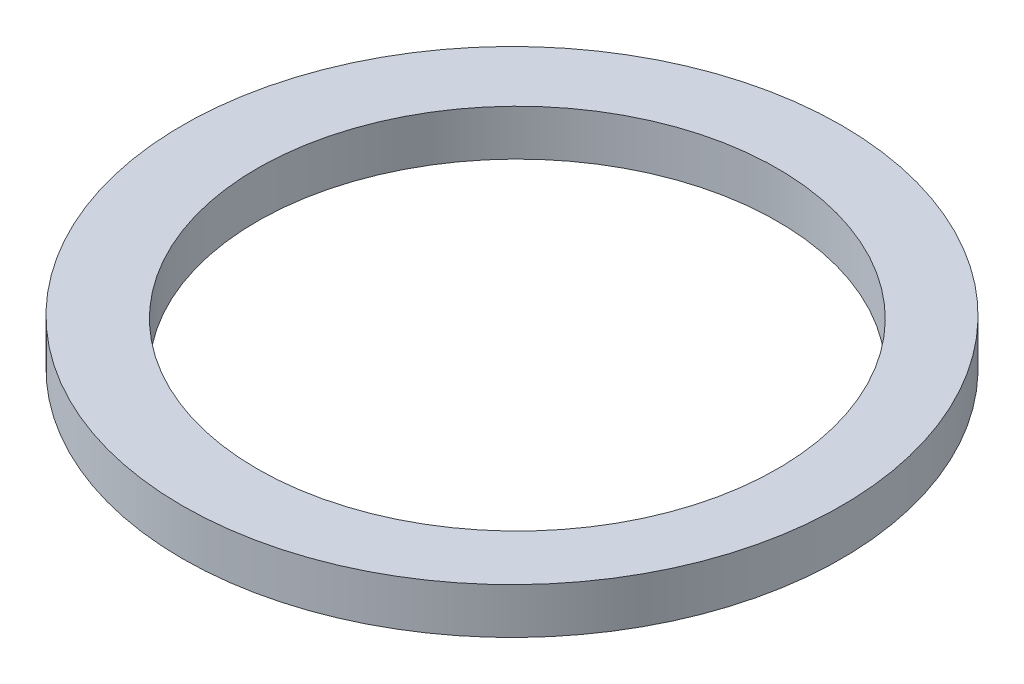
from build123d import *

# Parameters (mm, degrees)
SKETCH1_R          = 12.065
EXTRUDE1_DEPTH     = 1.6764
SKETCH2_R          = 9.525
CUT_EXTRUDE1_DEPTH = 2.54


with BuildPart() as part:
    # Sketch1 → Extrude1 (new body)
    with BuildSketch(Plane(origin=(0, 0, 0), x_dir=(1, 0, 0), z_dir=(0, 1, 0))):
        with Locations(Location((0, 0, 0), (0, 0, 270))):
            Circle(SKETCH1_R)
    extrude(amount=EXTRUDE1_DEPTH)

    # Sketch2 → Cut-Extrude1 (cut)
    with BuildSketch(Plane(origin=(0, 1.6764, 0), x_dir=(-1, 0, 0), z_dir=(0, 1, 0))):
        with Locations(Location((-0.195226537, 0, 0), (0, 0, 90))):
            Circle(SKETCH2_R)
    extrude(amount=-CUT_EXTRUDE1_DEPTH, mode=Mode.SUBTRACT)


solid = part.part
